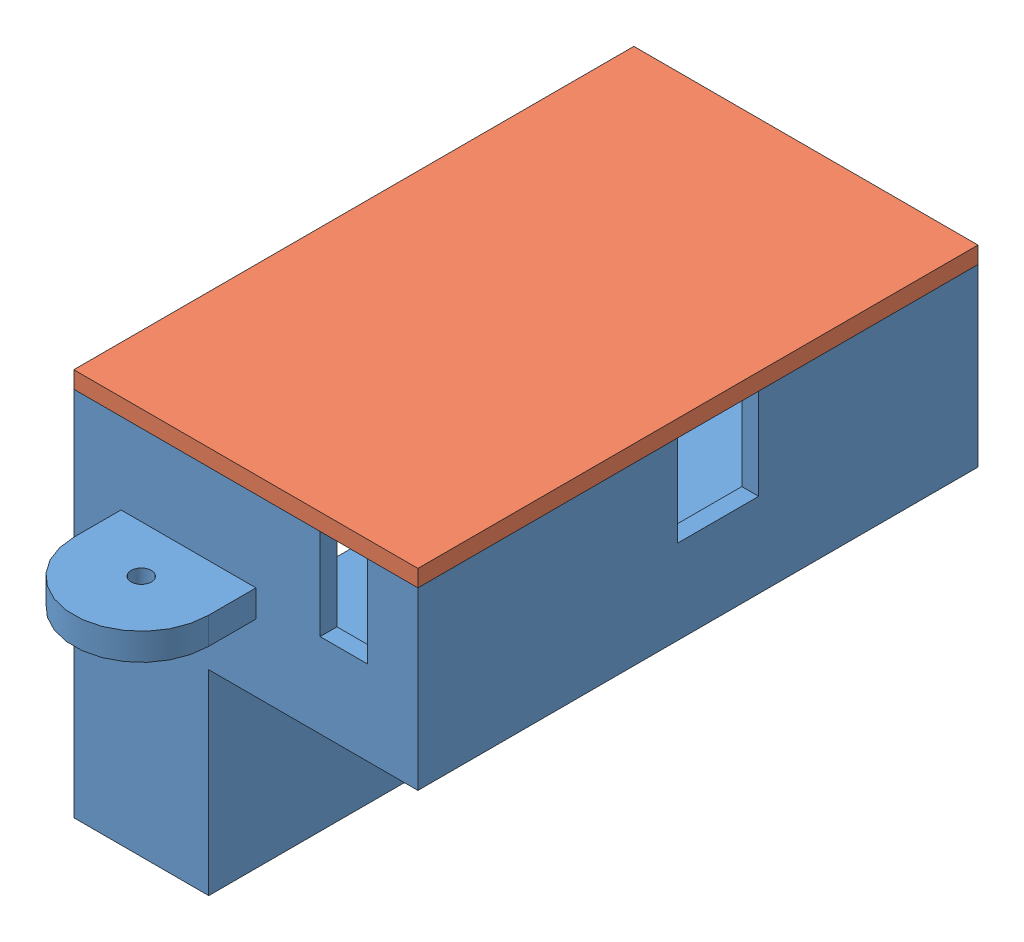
SolidWorks assembly LCDBox.SLDASM, configuration Default (file format 9000). Lengths in mm.
Overall size (51 57.5 100).
2 component instances, 2 part files, 3 mates.
Components (placement in the parent):
- LCDBoxBottom-1: LCDBoxBottom.SLDPRT [Default] at (-26.4511 -39.2067 21.9112) size (51 55 100)
- LCDBoxTopCover-1: LCDBoxTopCover.sldprt [Default] at (169.5936 15.7933 -19.7283) size (51 13.5 83)
Mates (geometry in assembly coordinates):
- Coincident1: coincident anti-aligned: plane of LCDBoxBottom-1 through (-26.4511 15.7933 21.9112) normal (0 1 0); plane of LCDBoxTopCover-1 through (169.5936 15.7933 -19.7283) normal (0 -1 0)
- Coincident2: coincident aligned: plane of LCDBoxBottom-1 through (-51.9511 15.7933 -19.5888) normal (-1 0 0); plane of LCDBoxTopCover-1 through (-51.9511 18.2933 -19.5888) normal (-1 0 0)
- Coincident3: coincident aligned: plane of LCDBoxBottom-1 through (-51.9511 15.7933 63.4112) normal (0 0 1); plane of LCDBoxTopCover-1 through (-51.9511 18.2933 63.4112) normal (0 0 1)
